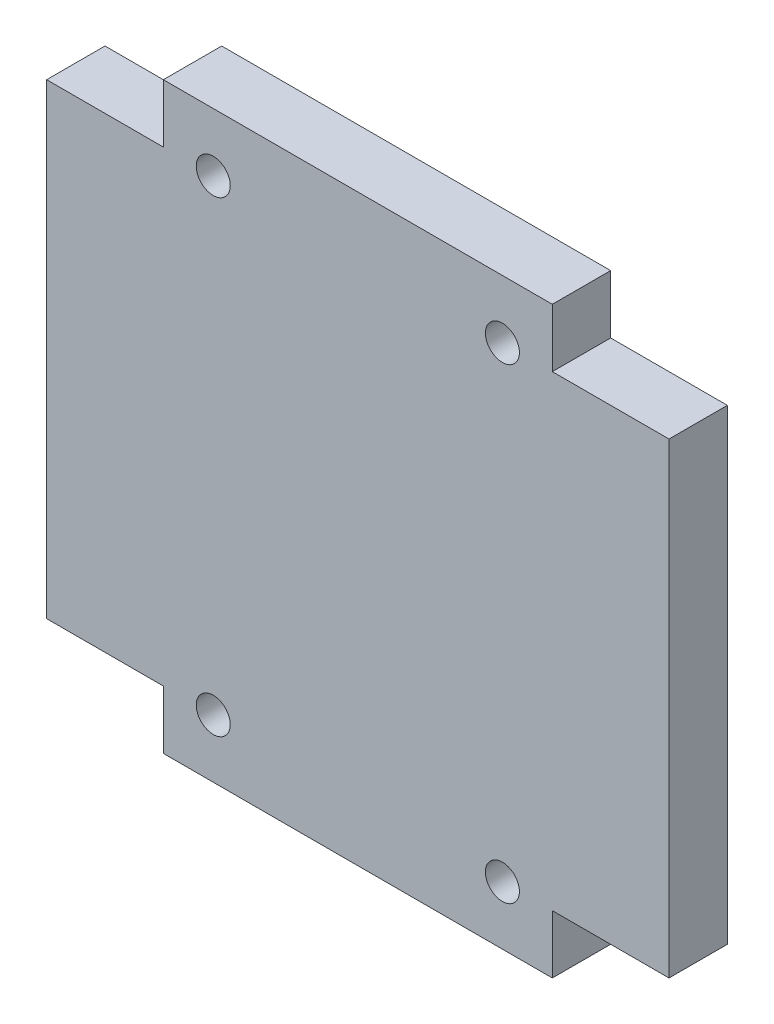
ISO-10303-21;
HEADER;
FILE_DESCRIPTION(('STEP AP214'),'2;1');
FILE_NAME('part.step','',(''),(''),'','','');
FILE_SCHEMA(('AUTOMOTIVE_DESIGN { 1 0 10303 214 1 1 1 1 }'));
ENDSEC;
DATA;
#1=APPLICATION_CONTEXT('core data for automotive mechanical design processes');
#2=APPLICATION_PROTOCOL_DEFINITION('international standard','automotive_design',2000,#1);
#3=PRODUCT_CONTEXT('',#1,'mechanical');
#4=PRODUCT('Part','Part','',(#3));
#5=PRODUCT_RELATED_PRODUCT_CATEGORY('part','',(#4));
#6=PRODUCT_DEFINITION_FORMATION('','',#4);
#7=PRODUCT_DEFINITION_CONTEXT('part definition',#1,'design');
#8=PRODUCT_DEFINITION('design','',#6,#7);
#9=PRODUCT_DEFINITION_SHAPE('','',#8);
#10=(LENGTH_UNIT() NAMED_UNIT(*) SI_UNIT(.MILLI.,.METRE.));
#11=(NAMED_UNIT(*) PLANE_ANGLE_UNIT() SI_UNIT($,.RADIAN.));
#12=(NAMED_UNIT(*) SI_UNIT($,.STERADIAN.) SOLID_ANGLE_UNIT());
#13=UNCERTAINTY_MEASURE_WITH_UNIT(LENGTH_MEASURE(1.E-05),#10,'distance_accuracy_value','');
#14=(GEOMETRIC_REPRESENTATION_CONTEXT(3) GLOBAL_UNCERTAINTY_ASSIGNED_CONTEXT((#13)) GLOBAL_UNIT_ASSIGNED_CONTEXT((#10,
#11,#12)) REPRESENTATION_CONTEXT('',''));
#15=CARTESIAN_POINT('',(0.,0.,0.));
#16=DIRECTION('',(0.,0.,1.));
#17=DIRECTION('',(1.,0.,0.));
#18=AXIS2_PLACEMENT_3D('',#15,#16,#17);
#19=CARTESIAN_POINT('',(-211.342156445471,-295.028662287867,3.));
#20=DIRECTION('',(-1.,0.,0.));
#21=DIRECTION('',(0.,0.,1.));
#22=AXIS2_PLACEMENT_3D('',#19,#20,#21);
#23=PLANE('',#22);
#24=DIRECTION('',(0.,1.,0.));
#25=VECTOR('',#24,1.);
#26=CARTESIAN_POINT('',(-211.342156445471,-295.028662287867,0.));
#27=LINE('',#26,#25);
#28=CARTESIAN_POINT('',(-211.342156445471,-295.028662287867,0.));
#29=VERTEX_POINT('',#28);
#30=CARTESIAN_POINT('',(-211.342156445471,-271.028662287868,0.));
#31=VERTEX_POINT('',#30);
#32=EDGE_CURVE('E153',#29,#31,#27,.T.);
#33=ORIENTED_EDGE('',*,*,#32,.T.);
#34=DIRECTION('',(0.,0.,-1.));
#35=VECTOR('',#34,1.);
#36=CARTESIAN_POINT('',(-211.342156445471,-271.028662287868,3.));
#37=LINE('',#36,#35);
#38=CARTESIAN_POINT('',(-211.342156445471,-271.028662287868,3.));
#39=VERTEX_POINT('',#38);
#40=EDGE_CURVE('E11',#39,#31,#37,.T.);
#41=ORIENTED_EDGE('',*,*,#40,.F.);
#42=DIRECTION('',(0.,1.,0.));
#43=VECTOR('',#42,1.);
#44=CARTESIAN_POINT('',(-211.342156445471,-295.028662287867,3.));
#45=LINE('',#44,#43);
#46=CARTESIAN_POINT('',(-211.342156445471,-295.028662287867,3.));
#47=VERTEX_POINT('',#46);
#48=EDGE_CURVE('E176',#47,#39,#45,.T.);
#49=ORIENTED_EDGE('',*,*,#48,.F.);
#50=DIRECTION('',(0.,0.,-1.));
#51=VECTOR('',#50,1.);
#52=CARTESIAN_POINT('',(-211.342156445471,-295.028662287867,3.));
#53=LINE('',#52,#51);
#54=EDGE_CURVE('E149',#47,#29,#53,.T.);
#55=ORIENTED_EDGE('',*,*,#54,.T.);
#56=EDGE_LOOP('',(#33,#41,#49,#55));
#57=FACE_BOUND('',#56,.T.);
#58=ADVANCED_FACE('F33',(#57),#23,.F.);
#59=CARTESIAN_POINT('',(-211.342156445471,-271.028662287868,3.));
#60=DIRECTION('',(0.,-1.,0.));
#61=DIRECTION('',(0.,0.,-1.));
#62=AXIS2_PLACEMENT_3D('',#59,#60,#61);
#63=PLANE('',#62);
#64=DIRECTION('',(-1.,0.,0.));
#65=VECTOR('',#64,1.);
#66=CARTESIAN_POINT('',(-211.342156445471,-271.028662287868,0.));
#67=LINE('',#66,#65);
#68=CARTESIAN_POINT('',(-217.342156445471,-271.028662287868,0.));
#69=VERTEX_POINT('',#68);
#70=EDGE_CURVE('E156',#31,#69,#67,.T.);
#71=ORIENTED_EDGE('',*,*,#70,.T.);
#72=DIRECTION('',(0.,0.,-1.));
#73=VECTOR('',#72,1.);
#74=CARTESIAN_POINT('',(-217.342156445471,-271.028662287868,3.));
#75=LINE('',#74,#73);
#76=CARTESIAN_POINT('',(-217.342156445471,-271.028662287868,3.));
#77=VERTEX_POINT('',#76);
#78=EDGE_CURVE('E41',#77,#69,#75,.T.);
#79=ORIENTED_EDGE('',*,*,#78,.F.);
#80=DIRECTION('',(-1.,0.,0.));
#81=VECTOR('',#80,1.);
#82=CARTESIAN_POINT('',(-211.342156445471,-271.028662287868,3.));
#83=LINE('',#82,#81);
#84=EDGE_CURVE('E104',#39,#77,#83,.T.);
#85=ORIENTED_EDGE('',*,*,#84,.F.);
#86=ORIENTED_EDGE('',*,*,#40,.T.);
#87=EDGE_LOOP('',(#71,#79,#85,#86));
#88=FACE_BOUND('',#87,.T.);
#89=ADVANCED_FACE('F255',(#88),#63,.F.);
#90=CARTESIAN_POINT('',(-217.342156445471,-271.028662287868,3.));
#91=DIRECTION('',(-1.,0.,0.));
#92=DIRECTION('',(0.,0.,1.));
#93=AXIS2_PLACEMENT_3D('',#90,#91,#92);
#94=PLANE('',#93);
#95=DIRECTION('',(0.,1.,0.));
#96=VECTOR('',#95,1.);
#97=CARTESIAN_POINT('',(-217.342156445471,-271.028662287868,0.));
#98=LINE('',#97,#96);
#99=CARTESIAN_POINT('',(-217.342156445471,-268.028662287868,0.));
#100=VERTEX_POINT('',#99);
#101=EDGE_CURVE('E159',#69,#100,#98,.T.);
#102=ORIENTED_EDGE('',*,*,#101,.T.);
#103=DIRECTION('',(0.,0.,-1.));
#104=VECTOR('',#103,1.);
#105=CARTESIAN_POINT('',(-217.342156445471,-268.028662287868,3.));
#106=LINE('',#105,#104);
#107=CARTESIAN_POINT('',(-217.342156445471,-268.028662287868,3.));
#108=VERTEX_POINT('',#107);
#109=EDGE_CURVE('E195',#108,#100,#106,.T.);
#110=ORIENTED_EDGE('',*,*,#109,.F.);
#111=DIRECTION('',(0.,1.,0.));
#112=VECTOR('',#111,1.);
#113=CARTESIAN_POINT('',(-217.342156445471,-271.028662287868,3.));
#114=LINE('',#113,#112);
#115=EDGE_CURVE('E203',#77,#108,#114,.T.);
#116=ORIENTED_EDGE('',*,*,#115,.F.);
#117=ORIENTED_EDGE('',*,*,#78,.T.);
#118=EDGE_LOOP('',(#102,#110,#116,#117));
#119=FACE_BOUND('',#118,.T.);
#120=ADVANCED_FACE('F201',(#119),#94,.F.);
#121=CARTESIAN_POINT('',(-217.342156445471,-268.028662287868,3.));
#122=DIRECTION('',(0.,-1.,0.));
#123=DIRECTION('',(0.,0.,-1.));
#124=AXIS2_PLACEMENT_3D('',#121,#122,#123);
#125=PLANE('',#124);
#126=DIRECTION('',(-1.,0.,0.));
#127=VECTOR('',#126,1.);
#128=CARTESIAN_POINT('',(-217.342156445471,-268.028662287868,0.));
#129=LINE('',#128,#127);
#130=CARTESIAN_POINT('',(-237.342156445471,-268.028662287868,0.));
#131=VERTEX_POINT('',#130);
#132=EDGE_CURVE('E161',#100,#131,#129,.T.);
#133=ORIENTED_EDGE('',*,*,#132,.T.);
#134=DIRECTION('',(0.,0.,-1.));
#135=VECTOR('',#134,1.);
#136=CARTESIAN_POINT('',(-237.342156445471,-268.028662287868,3.));
#137=LINE('',#136,#135);
#138=CARTESIAN_POINT('',(-237.342156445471,-268.028662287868,3.));
#139=VERTEX_POINT('',#138);
#140=EDGE_CURVE('E192',#139,#131,#137,.T.);
#141=ORIENTED_EDGE('',*,*,#140,.F.);
#142=DIRECTION('',(-1.,0.,0.));
#143=VECTOR('',#142,1.);
#144=CARTESIAN_POINT('',(-217.342156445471,-268.028662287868,3.));
#145=LINE('',#144,#143);
#146=EDGE_CURVE('E221',#108,#139,#145,.T.);
#147=ORIENTED_EDGE('',*,*,#146,.F.);
#148=ORIENTED_EDGE('',*,*,#109,.T.);
#149=EDGE_LOOP('',(#133,#141,#147,#148));
#150=FACE_BOUND('',#149,.T.);
#151=ADVANCED_FACE('F212',(#150),#125,.F.);
#152=CARTESIAN_POINT('',(-237.342156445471,-268.028662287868,3.));
#153=DIRECTION('',(1.,0.,0.));
#154=DIRECTION('',(0.,0.,-1.));
#155=AXIS2_PLACEMENT_3D('',#152,#153,#154);
#156=PLANE('',#155);
#157=DIRECTION('',(0.,-1.,0.));
#158=VECTOR('',#157,1.);
#159=CARTESIAN_POINT('',(-237.342156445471,-268.028662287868,0.));
#160=LINE('',#159,#158);
#161=CARTESIAN_POINT('',(-237.342156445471,-271.028662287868,0.));
#162=VERTEX_POINT('',#161);
#163=EDGE_CURVE('E163',#131,#162,#160,.T.);
#164=ORIENTED_EDGE('',*,*,#163,.T.);
#165=DIRECTION('',(0.,0.,-1.));
#166=VECTOR('',#165,1.);
#167=CARTESIAN_POINT('',(-237.342156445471,-271.028662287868,3.));
#168=LINE('',#167,#166);
#169=CARTESIAN_POINT('',(-237.342156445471,-271.028662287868,3.));
#170=VERTEX_POINT('',#169);
#171=EDGE_CURVE('E189',#170,#162,#168,.T.);
#172=ORIENTED_EDGE('',*,*,#171,.F.);
#173=DIRECTION('',(0.,-1.,0.));
#174=VECTOR('',#173,1.);
#175=CARTESIAN_POINT('',(-237.342156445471,-268.028662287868,3.));
#176=LINE('',#175,#174);
#177=EDGE_CURVE('E218',#139,#170,#176,.T.);
#178=ORIENTED_EDGE('',*,*,#177,.F.);
#179=ORIENTED_EDGE('',*,*,#140,.T.);
#180=EDGE_LOOP('',(#164,#172,#178,#179));
#181=FACE_BOUND('',#180,.T.);
#182=ADVANCED_FACE('F216',(#181),#156,.F.);
#183=CARTESIAN_POINT('',(-237.342156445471,-271.028662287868,3.));
#184=DIRECTION('',(0.,-1.,0.));
#185=DIRECTION('',(0.,0.,-1.));
#186=AXIS2_PLACEMENT_3D('',#183,#184,#185);
#187=PLANE('',#186);
#188=DIRECTION('',(-1.,0.,0.));
#189=VECTOR('',#188,1.);
#190=CARTESIAN_POINT('',(-237.342156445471,-271.028662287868,0.));
#191=LINE('',#190,#189);
#192=CARTESIAN_POINT('',(-243.342156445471,-271.028662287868,0.));
#193=VERTEX_POINT('',#192);
#194=EDGE_CURVE('E165',#162,#193,#191,.T.);
#195=ORIENTED_EDGE('',*,*,#194,.T.);
#196=DIRECTION('',(0.,0.,-1.));
#197=VECTOR('',#196,1.);
#198=CARTESIAN_POINT('',(-243.342156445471,-271.028662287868,3.));
#199=LINE('',#198,#197);
#200=CARTESIAN_POINT('',(-243.342156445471,-271.028662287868,3.));
#201=VERTEX_POINT('',#200);
#202=EDGE_CURVE('E186',#201,#193,#199,.T.);
#203=ORIENTED_EDGE('',*,*,#202,.F.);
#204=DIRECTION('',(-1.,0.,0.));
#205=VECTOR('',#204,1.);
#206=CARTESIAN_POINT('',(-237.342156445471,-271.028662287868,3.));
#207=LINE('',#206,#205);
#208=EDGE_CURVE('E220',#170,#201,#207,.T.);
#209=ORIENTED_EDGE('',*,*,#208,.F.);
#210=ORIENTED_EDGE('',*,*,#171,.T.);
#211=EDGE_LOOP('',(#195,#203,#209,#210));
#212=FACE_BOUND('',#211,.T.);
#213=ADVANCED_FACE('F268',(#212),#187,.F.);
#214=CARTESIAN_POINT('',(-243.342156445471,-271.028662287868,3.));
#215=DIRECTION('',(1.,0.,0.));
#216=DIRECTION('',(0.,0.,-1.));
#217=AXIS2_PLACEMENT_3D('',#214,#215,#216);
#218=PLANE('',#217);
#219=DIRECTION('',(0.,-1.,0.));
#220=VECTOR('',#219,1.);
#221=CARTESIAN_POINT('',(-243.342156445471,-271.028662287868,0.));
#222=LINE('',#221,#220);
#223=CARTESIAN_POINT('',(-243.342156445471,-295.028662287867,0.));
#224=VERTEX_POINT('',#223);
#225=EDGE_CURVE('E167',#193,#224,#222,.T.);
#226=ORIENTED_EDGE('',*,*,#225,.T.);
#227=DIRECTION('',(0.,0.,-1.));
#228=VECTOR('',#227,1.);
#229=CARTESIAN_POINT('',(-243.342156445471,-295.028662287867,3.));
#230=LINE('',#229,#228);
#231=CARTESIAN_POINT('',(-243.342156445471,-295.028662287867,3.));
#232=VERTEX_POINT('',#231);
#233=EDGE_CURVE('E183',#232,#224,#230,.T.);
#234=ORIENTED_EDGE('',*,*,#233,.F.);
#235=DIRECTION('',(0.,-1.,0.));
#236=VECTOR('',#235,1.);
#237=CARTESIAN_POINT('',(-243.342156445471,-271.028662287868,3.));
#238=LINE('',#237,#236);
#239=EDGE_CURVE('E223',#201,#232,#238,.T.);
#240=ORIENTED_EDGE('',*,*,#239,.F.);
#241=ORIENTED_EDGE('',*,*,#202,.T.);
#242=EDGE_LOOP('',(#226,#234,#240,#241));
#243=FACE_BOUND('',#242,.T.);
#244=ADVANCED_FACE('F271',(#243),#218,.F.);
#245=CARTESIAN_POINT('',(-243.342156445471,-295.028662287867,3.));
#246=DIRECTION('',(0.,1.,0.));
#247=DIRECTION('',(0.,0.,1.));
#248=AXIS2_PLACEMENT_3D('',#245,#246,#247);
#249=PLANE('',#248);
#250=DIRECTION('',(1.,0.,0.));
#251=VECTOR('',#250,1.);
#252=CARTESIAN_POINT('',(-243.342156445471,-295.028662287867,0.));
#253=LINE('',#252,#251);
#254=CARTESIAN_POINT('',(-237.342156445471,-295.028662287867,0.));
#255=VERTEX_POINT('',#254);
#256=EDGE_CURVE('E169',#224,#255,#253,.T.);
#257=ORIENTED_EDGE('',*,*,#256,.T.);
#258=DIRECTION('',(0.,0.,-1.));
#259=VECTOR('',#258,1.);
#260=CARTESIAN_POINT('',(-237.342156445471,-295.028662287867,3.));
#261=LINE('',#260,#259);
#262=CARTESIAN_POINT('',(-237.342156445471,-295.028662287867,3.));
#263=VERTEX_POINT('',#262);
#264=EDGE_CURVE('E180',#263,#255,#261,.T.);
#265=ORIENTED_EDGE('',*,*,#264,.F.);
#266=DIRECTION('',(1.,0.,0.));
#267=VECTOR('',#266,1.);
#268=CARTESIAN_POINT('',(-243.342156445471,-295.028662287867,3.));
#269=LINE('',#268,#267);
#270=EDGE_CURVE('E229',#232,#263,#269,.T.);
#271=ORIENTED_EDGE('',*,*,#270,.F.);
#272=ORIENTED_EDGE('',*,*,#233,.T.);
#273=EDGE_LOOP('',(#257,#265,#271,#272));
#274=FACE_BOUND('',#273,.T.);
#275=ADVANCED_FACE('F235',(#274),#249,.F.);
#276=CARTESIAN_POINT('',(-237.342156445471,-295.028662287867,3.));
#277=DIRECTION('',(1.,0.,0.));
#278=DIRECTION('',(0.,0.,-1.));
#279=AXIS2_PLACEMENT_3D('',#276,#277,#278);
#280=PLANE('',#279);
#281=DIRECTION('',(0.,-1.,0.));
#282=VECTOR('',#281,1.);
#283=CARTESIAN_POINT('',(-237.342156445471,-295.028662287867,0.));
#284=LINE('',#283,#282);
#285=CARTESIAN_POINT('',(-237.342156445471,-298.028662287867,0.));
#286=VERTEX_POINT('',#285);
#287=EDGE_CURVE('E171',#255,#286,#284,.T.);
#288=ORIENTED_EDGE('',*,*,#287,.T.);
#289=DIRECTION('',(0.,0.,-1.));
#290=VECTOR('',#289,1.);
#291=CARTESIAN_POINT('',(-237.342156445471,-298.028662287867,3.));
#292=LINE('',#291,#290);
#293=CARTESIAN_POINT('',(-237.342156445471,-298.028662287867,3.));
#294=VERTEX_POINT('',#293);
#295=EDGE_CURVE('E144',#294,#286,#292,.T.);
#296=ORIENTED_EDGE('',*,*,#295,.F.);
#297=DIRECTION('',(0.,-1.,0.));
#298=VECTOR('',#297,1.);
#299=CARTESIAN_POINT('',(-237.342156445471,-295.028662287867,3.));
#300=LINE('',#299,#298);
#301=EDGE_CURVE('E135',#263,#294,#300,.T.);
#302=ORIENTED_EDGE('',*,*,#301,.F.);
#303=ORIENTED_EDGE('',*,*,#264,.T.);
#304=EDGE_LOOP('',(#288,#296,#302,#303));
#305=FACE_BOUND('',#304,.T.);
#306=ADVANCED_FACE('F239',(#305),#280,.F.);
#307=CARTESIAN_POINT('',(-237.342156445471,-298.028662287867,3.));
#308=DIRECTION('',(0.,1.,0.));
#309=DIRECTION('',(0.,0.,1.));
#310=AXIS2_PLACEMENT_3D('',#307,#308,#309);
#311=PLANE('',#310);
#312=DIRECTION('',(1.,0.,0.));
#313=VECTOR('',#312,1.);
#314=CARTESIAN_POINT('',(-237.342156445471,-298.028662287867,0.));
#315=LINE('',#314,#313);
#316=CARTESIAN_POINT('',(-217.342156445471,-298.028662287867,0.));
#317=VERTEX_POINT('',#316);
#318=EDGE_CURVE('E143',#286,#317,#315,.T.);
#319=ORIENTED_EDGE('',*,*,#318,.T.);
#320=DIRECTION('',(0.,0.,-1.));
#321=VECTOR('',#320,1.);
#322=CARTESIAN_POINT('',(-217.342156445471,-298.028662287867,3.));
#323=LINE('',#322,#321);
#324=CARTESIAN_POINT('',(-217.342156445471,-298.028662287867,3.));
#325=VERTEX_POINT('',#324);
#326=EDGE_CURVE('E140',#325,#317,#323,.T.);
#327=ORIENTED_EDGE('',*,*,#326,.F.);
#328=DIRECTION('',(1.,0.,0.));
#329=VECTOR('',#328,1.);
#330=CARTESIAN_POINT('',(-237.342156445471,-298.028662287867,3.));
#331=LINE('',#330,#329);
#332=EDGE_CURVE('E129',#294,#325,#331,.T.);
#333=ORIENTED_EDGE('',*,*,#332,.F.);
#334=ORIENTED_EDGE('',*,*,#295,.T.);
#335=EDGE_LOOP('',(#319,#327,#333,#334));
#336=FACE_BOUND('',#335,.T.);
#337=ADVANCED_FACE('F141',(#336),#311,.F.);
#338=CARTESIAN_POINT('',(-217.342156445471,-298.028662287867,3.));
#339=DIRECTION('',(-1.,0.,0.));
#340=DIRECTION('',(0.,0.,1.));
#341=AXIS2_PLACEMENT_3D('',#338,#339,#340);
#342=PLANE('',#341);
#343=DIRECTION('',(0.,1.,0.));
#344=VECTOR('',#343,1.);
#345=CARTESIAN_POINT('',(-217.342156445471,-298.028662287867,0.));
#346=LINE('',#345,#344);
#347=CARTESIAN_POINT('',(-217.342156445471,-295.028662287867,0.));
#348=VERTEX_POINT('',#347);
#349=EDGE_CURVE('E90',#317,#348,#346,.T.);
#350=ORIENTED_EDGE('',*,*,#349,.T.);
#351=DIRECTION('',(0.,0.,-1.));
#352=VECTOR('',#351,1.);
#353=CARTESIAN_POINT('',(-217.342156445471,-295.028662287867,3.));
#354=LINE('',#353,#352);
#355=CARTESIAN_POINT('',(-217.342156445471,-295.028662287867,3.));
#356=VERTEX_POINT('',#355);
#357=EDGE_CURVE('E145',#356,#348,#354,.T.);
#358=ORIENTED_EDGE('',*,*,#357,.F.);
#359=DIRECTION('',(0.,1.,0.));
#360=VECTOR('',#359,1.);
#361=CARTESIAN_POINT('',(-217.342156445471,-298.028662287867,3.));
#362=LINE('',#361,#360);
#363=EDGE_CURVE('E133',#325,#356,#362,.T.);
#364=ORIENTED_EDGE('',*,*,#363,.F.);
#365=ORIENTED_EDGE('',*,*,#326,.T.);
#366=EDGE_LOOP('',(#350,#358,#364,#365));
#367=FACE_BOUND('',#366,.T.);
#368=ADVANCED_FACE('F147',(#367),#342,.F.);
#369=CARTESIAN_POINT('',(-217.342156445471,-295.028662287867,3.));
#370=DIRECTION('',(0.,1.,0.));
#371=DIRECTION('',(0.,0.,1.));
#372=AXIS2_PLACEMENT_3D('',#369,#370,#371);
#373=PLANE('',#372);
#374=DIRECTION('',(1.,0.,0.));
#375=VECTOR('',#374,1.);
#376=CARTESIAN_POINT('',(-217.342156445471,-295.028662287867,0.));
#377=LINE('',#376,#375);
#378=EDGE_CURVE('E96',#348,#29,#377,.T.);
#379=ORIENTED_EDGE('',*,*,#378,.T.);
#380=ORIENTED_EDGE('',*,*,#54,.F.);
#381=DIRECTION('',(1.,0.,0.));
#382=VECTOR('',#381,1.);
#383=CARTESIAN_POINT('',(-217.342156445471,-295.028662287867,3.));
#384=LINE('',#383,#382);
#385=EDGE_CURVE('E49',#356,#47,#384,.T.);
#386=ORIENTED_EDGE('',*,*,#385,.F.);
#387=ORIENTED_EDGE('',*,*,#357,.T.);
#388=EDGE_LOOP('',(#379,#380,#386,#387));
#389=FACE_BOUND('',#388,.T.);
#390=ADVANCED_FACE('F243',(#389),#373,.F.);
#391=CARTESIAN_POINT('',(0.,0.,3.));
#392=DIRECTION('',(0.,0.,1.));
#393=DIRECTION('',(1.,0.,0.));
#394=AXIS2_PLACEMENT_3D('',#391,#392,#393);
#395=PLANE('',#394);
#396=CARTESIAN_POINT('',(-234.775876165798,-295.028662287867,3.));
#397=DIRECTION('',(0.,0.,1.));
#398=DIRECTION('',(1.,0.,0.));
#399=AXIS2_PLACEMENT_3D('',#396,#397,#398);
#400=CIRCLE('',#399,0.874999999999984);
#401=CARTESIAN_POINT('',(-233.900876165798,-295.028662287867,3.));
#402=VERTEX_POINT('',#401);
#403=EDGE_CURVE('E357',#402,#402,#400,.T.);
#404=ORIENTED_EDGE('',*,*,#403,.F.);
#405=EDGE_LOOP('',(#404));
#406=FACE_BOUND('',#405,.T.);
#407=CARTESIAN_POINT('',(-234.775876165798,-271.028662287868,3.));
#408=DIRECTION('',(0.,0.,1.));
#409=DIRECTION('',(1.,0.,0.));
#410=AXIS2_PLACEMENT_3D('',#407,#408,#409);
#411=CIRCLE('',#410,0.874999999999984);
#412=CARTESIAN_POINT('',(-233.900876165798,-271.028662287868,3.));
#413=VERTEX_POINT('',#412);
#414=EDGE_CURVE('E359',#413,#413,#411,.T.);
#415=ORIENTED_EDGE('',*,*,#414,.F.);
#416=EDGE_LOOP('',(#415));
#417=FACE_BOUND('',#416,.T.);
#418=CARTESIAN_POINT('',(-219.908436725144,-295.028662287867,3.));
#419=DIRECTION('',(0.,0.,1.));
#420=DIRECTION('',(1.,0.,0.));
#421=AXIS2_PLACEMENT_3D('',#418,#419,#420);
#422=CIRCLE('',#421,0.874999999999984);
#423=CARTESIAN_POINT('',(-219.033436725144,-295.028662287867,3.));
#424=VERTEX_POINT('',#423);
#425=EDGE_CURVE('E365',#424,#424,#422,.T.);
#426=ORIENTED_EDGE('',*,*,#425,.F.);
#427=EDGE_LOOP('',(#426));
#428=FACE_BOUND('',#427,.T.);
#429=CARTESIAN_POINT('',(-219.908436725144,-271.028662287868,3.));
#430=DIRECTION('',(0.,0.,1.));
#431=DIRECTION('',(1.,0.,0.));
#432=AXIS2_PLACEMENT_3D('',#429,#430,#431);
#433=CIRCLE('',#432,0.874999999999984);
#434=CARTESIAN_POINT('',(-219.033436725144,-271.028662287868,3.));
#435=VERTEX_POINT('',#434);
#436=EDGE_CURVE('E371',#435,#435,#433,.T.);
#437=ORIENTED_EDGE('',*,*,#436,.F.);
#438=EDGE_LOOP('',(#437));
#439=FACE_BOUND('',#438,.T.);
#440=ORIENTED_EDGE('',*,*,#48,.T.);
#441=ORIENTED_EDGE('',*,*,#84,.T.);
#442=ORIENTED_EDGE('',*,*,#115,.T.);
#443=ORIENTED_EDGE('',*,*,#146,.T.);
#444=ORIENTED_EDGE('',*,*,#177,.T.);
#445=ORIENTED_EDGE('',*,*,#208,.T.);
#446=ORIENTED_EDGE('',*,*,#239,.T.);
#447=ORIENTED_EDGE('',*,*,#270,.T.);
#448=ORIENTED_EDGE('',*,*,#301,.T.);
#449=ORIENTED_EDGE('',*,*,#332,.T.);
#450=ORIENTED_EDGE('',*,*,#363,.T.);
#451=ORIENTED_EDGE('',*,*,#385,.T.);
#452=EDGE_LOOP('',(#440,#441,#442,#443,#444,#445,#446,#447,#448,#449,#450,#451));
#453=FACE_BOUND('',#452,.T.);
#454=ADVANCED_FACE('F131',(#406,#417,#428,#439,#453),#395,.T.);
#455=CARTESIAN_POINT('',(0.,0.,0.));
#456=DIRECTION('',(0.,0.,1.));
#457=DIRECTION('',(1.,0.,0.));
#458=AXIS2_PLACEMENT_3D('',#455,#456,#457);
#459=PLANE('',#458);
#460=CARTESIAN_POINT('',(-234.775876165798,-295.028662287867,0.));
#461=DIRECTION('',(0.,0.,1.));
#462=DIRECTION('',(1.,0.,0.));
#463=AXIS2_PLACEMENT_3D('',#460,#461,#462);
#464=CIRCLE('',#463,0.874999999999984);
#465=CARTESIAN_POINT('',(-233.900876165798,-295.028662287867,0.));
#466=VERTEX_POINT('',#465);
#467=EDGE_CURVE('E354',#466,#466,#464,.T.);
#468=ORIENTED_EDGE('',*,*,#467,.T.);
#469=EDGE_LOOP('',(#468));
#470=FACE_BOUND('',#469,.T.);
#471=CARTESIAN_POINT('',(-234.775876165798,-271.028662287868,0.));
#472=DIRECTION('',(0.,0.,1.));
#473=DIRECTION('',(1.,0.,0.));
#474=AXIS2_PLACEMENT_3D('',#471,#472,#473);
#475=CIRCLE('',#474,0.874999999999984);
#476=CARTESIAN_POINT('',(-233.900876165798,-271.028662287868,0.));
#477=VERTEX_POINT('',#476);
#478=EDGE_CURVE('E362',#477,#477,#475,.T.);
#479=ORIENTED_EDGE('',*,*,#478,.T.);
#480=EDGE_LOOP('',(#479));
#481=FACE_BOUND('',#480,.T.);
#482=CARTESIAN_POINT('',(-219.908436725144,-295.028662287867,0.));
#483=DIRECTION('',(0.,0.,1.));
#484=DIRECTION('',(1.,0.,0.));
#485=AXIS2_PLACEMENT_3D('',#482,#483,#484);
#486=CIRCLE('',#485,0.874999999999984);
#487=CARTESIAN_POINT('',(-219.033436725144,-295.028662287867,0.));
#488=VERTEX_POINT('',#487);
#489=EDGE_CURVE('E368',#488,#488,#486,.T.);
#490=ORIENTED_EDGE('',*,*,#489,.T.);
#491=EDGE_LOOP('',(#490));
#492=FACE_BOUND('',#491,.T.);
#493=CARTESIAN_POINT('',(-219.908436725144,-271.028662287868,0.));
#494=DIRECTION('',(0.,0.,1.));
#495=DIRECTION('',(1.,0.,0.));
#496=AXIS2_PLACEMENT_3D('',#493,#494,#495);
#497=CIRCLE('',#496,0.874999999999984);
#498=CARTESIAN_POINT('',(-219.033436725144,-271.028662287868,0.));
#499=VERTEX_POINT('',#498);
#500=EDGE_CURVE('E157',#499,#499,#497,.T.);
#501=ORIENTED_EDGE('',*,*,#500,.T.);
#502=EDGE_LOOP('',(#501));
#503=FACE_BOUND('',#502,.T.);
#504=ORIENTED_EDGE('',*,*,#32,.F.);
#505=ORIENTED_EDGE('',*,*,#378,.F.);
#506=ORIENTED_EDGE('',*,*,#349,.F.);
#507=ORIENTED_EDGE('',*,*,#318,.F.);
#508=ORIENTED_EDGE('',*,*,#287,.F.);
#509=ORIENTED_EDGE('',*,*,#256,.F.);
#510=ORIENTED_EDGE('',*,*,#225,.F.);
#511=ORIENTED_EDGE('',*,*,#194,.F.);
#512=ORIENTED_EDGE('',*,*,#163,.F.);
#513=ORIENTED_EDGE('',*,*,#132,.F.);
#514=ORIENTED_EDGE('',*,*,#101,.F.);
#515=ORIENTED_EDGE('',*,*,#70,.F.);
#516=EDGE_LOOP('',(#504,#505,#506,#507,#508,#509,#510,#511,#512,#513,#514,#515));
#517=FACE_BOUND('',#516,.T.);
#518=ADVANCED_FACE('F207',(#470,#481,#492,#503,#517),#459,.F.);
#519=CARTESIAN_POINT('',(-219.908436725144,-271.028662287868,0.));
#520=DIRECTION('',(0.,0.,1.));
#521=DIRECTION('',(1.,0.,0.));
#522=AXIS2_PLACEMENT_3D('',#519,#520,#521);
#523=CYLINDRICAL_SURFACE('',#522,0.874999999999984);
#524=ORIENTED_EDGE('',*,*,#500,.F.);
#525=EDGE_LOOP('',(#524));
#526=FACE_BOUND('',#525,.T.);
#527=ORIENTED_EDGE('',*,*,#436,.T.);
#528=EDGE_LOOP('',(#527));
#529=FACE_BOUND('',#528,.T.);
#530=ADVANCED_FACE('F308',(#526,#529),#523,.F.);
#531=CARTESIAN_POINT('',(-219.908436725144,-295.028662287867,0.));
#532=DIRECTION('',(0.,0.,1.));
#533=DIRECTION('',(1.,0.,0.));
#534=AXIS2_PLACEMENT_3D('',#531,#532,#533);
#535=CYLINDRICAL_SURFACE('',#534,0.874999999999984);
#536=ORIENTED_EDGE('',*,*,#489,.F.);
#537=EDGE_LOOP('',(#536));
#538=FACE_BOUND('',#537,.T.);
#539=ORIENTED_EDGE('',*,*,#425,.T.);
#540=EDGE_LOOP('',(#539));
#541=FACE_BOUND('',#540,.T.);
#542=ADVANCED_FACE('F317',(#538,#541),#535,.F.);
#543=CARTESIAN_POINT('',(-234.775876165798,-271.028662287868,0.));
#544=DIRECTION('',(0.,0.,1.));
#545=DIRECTION('',(1.,0.,0.));
#546=AXIS2_PLACEMENT_3D('',#543,#544,#545);
#547=CYLINDRICAL_SURFACE('',#546,0.874999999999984);
#548=ORIENTED_EDGE('',*,*,#478,.F.);
#549=EDGE_LOOP('',(#548));
#550=FACE_BOUND('',#549,.T.);
#551=ORIENTED_EDGE('',*,*,#414,.T.);
#552=EDGE_LOOP('',(#551));
#553=FACE_BOUND('',#552,.T.);
#554=ADVANCED_FACE('F327',(#550,#553),#547,.F.);
#555=CARTESIAN_POINT('',(-234.775876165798,-295.028662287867,0.));
#556=DIRECTION('',(0.,0.,1.));
#557=DIRECTION('',(1.,0.,0.));
#558=AXIS2_PLACEMENT_3D('',#555,#556,#557);
#559=CYLINDRICAL_SURFACE('',#558,0.874999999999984);
#560=ORIENTED_EDGE('',*,*,#467,.F.);
#561=EDGE_LOOP('',(#560));
#562=FACE_BOUND('',#561,.T.);
#563=ORIENTED_EDGE('',*,*,#403,.T.);
#564=EDGE_LOOP('',(#563));
#565=FACE_BOUND('',#564,.T.);
#566=ADVANCED_FACE('F337',(#562,#565),#559,.F.);
#567=CLOSED_SHELL('',(#58,#89,#120,#151,#182,#213,#244,#275,#306,#337,#368,#390,#454,#518,#530,
#542,#554,#566));
#568=MANIFOLD_SOLID_BREP('B2',#567);
#569=ADVANCED_BREP_SHAPE_REPRESENTATION('',(#18,#568),#14);
#570=SHAPE_DEFINITION_REPRESENTATION(#9,#569);
ENDSEC;
END-ISO-10303-21;
